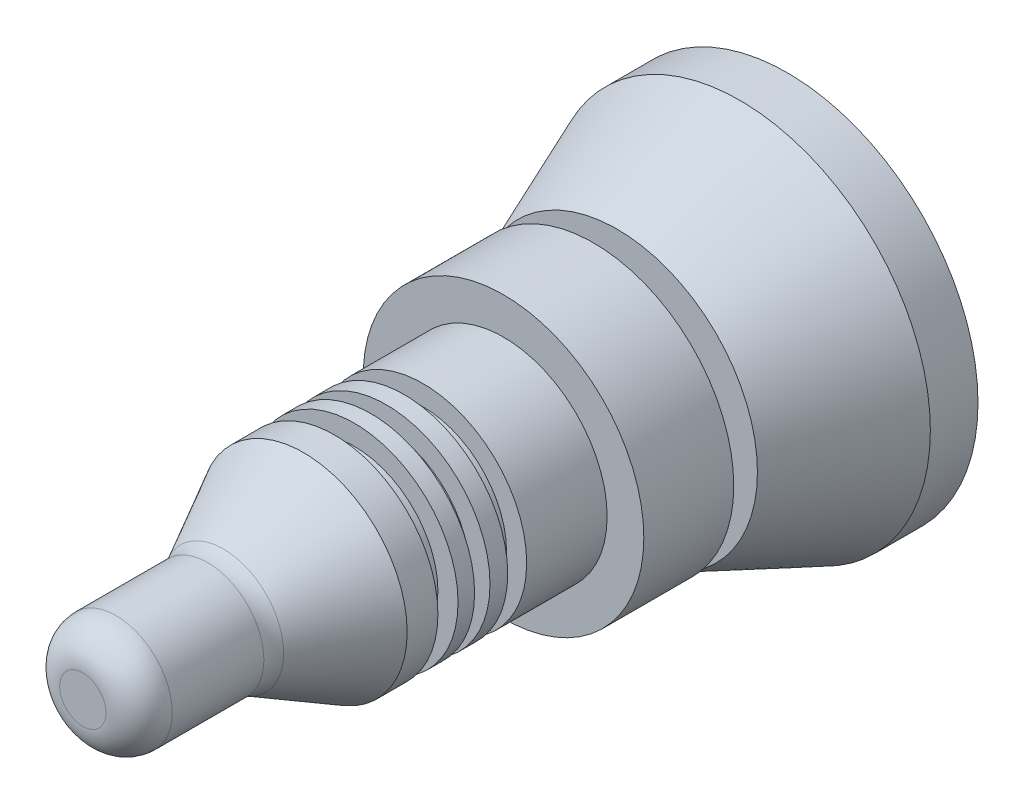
from build123d import *


with BuildPart() as part:
    # Sketch2 → Revolve1 (revolve)
    with BuildSketch(Plane(origin=(0, 0, 0), x_dir=(0, 0, -1), z_dir=(1, 0, 0)), mode=Mode.PRIVATE) as revolve1_sk:
        with BuildLine():
            Line((0, 0), (0, 7))
            ThreePointArc((0, 7), (2.928932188, 14.071067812), (10, 17))
            Line((10, 17), (37.683421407, 17))
            ThreePointArc((37.683421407, 17), (40.135904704, 17.305397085), (42.43859175, 18.202934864))
            Line((42.43859175, 18.202934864), (66.664486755, 31.298013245))
            Line((66.664486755, 31.298013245), (75.958195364, 31.298013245))
            Line((75.958195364, 31.298013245), (75.958195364, 25.221357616))
            Line((75.958195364, 25.221357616), (82.034850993, 25.221357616))
            Line((82.034850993, 25.221357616), (82.034850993, 31.298013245))
            Line((82.034850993, 31.298013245), (87.039155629, 31.298013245))
            Line((87.039155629, 31.298013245), (87.039155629, 25.221357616))
            Line((87.039155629, 25.221357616), (91.686009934, 25.221357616))
            Line((91.686009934, 25.221357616), (91.686009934, 31.298013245))
            Line((91.686009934, 31.298013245), (97.047764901, 31.298013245))
            Line((97.047764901, 31.298013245), (97.047764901, 25.221357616))
            Line((97.047764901, 25.221357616), (102.766970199, 25.221357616))
            Line((102.766970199, 25.221357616), (102.766970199, 31.298013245))
            Line((102.766970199, 31.298013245), (127.073592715, 31.298013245))
            Line((127.073592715, 31.298013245), (127.073592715, 42.37897351))
            Line((127.073592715, 42.37897351), (154.239817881, 42.37897351))
            Line((154.239817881, 42.37897351), (154.239817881, 22.719205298))
            Line((154.239817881, 22.719205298), (161.388824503, 22.719205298))
            Line((161.388824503, 22.719205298), (161.388824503, 42.37897351))
            Line((161.388824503, 42.37897351), (198.44705448, 57.555201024))
            Line((198.44705448, 57.555201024), (212.836397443, 57.555201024))
            Line((212.836397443, 57.555201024), (212.836397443, 0))
            Line((212.836397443, 0), (0, 0))
        make_face()
    revolve(revolve1_sk.sketch.rotate(Axis((0, 0, 62.732533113), (0, 0, -1)), 90), axis=Axis((0, 0, 62.732533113), (0, 0, -1)))


solid = part.part
